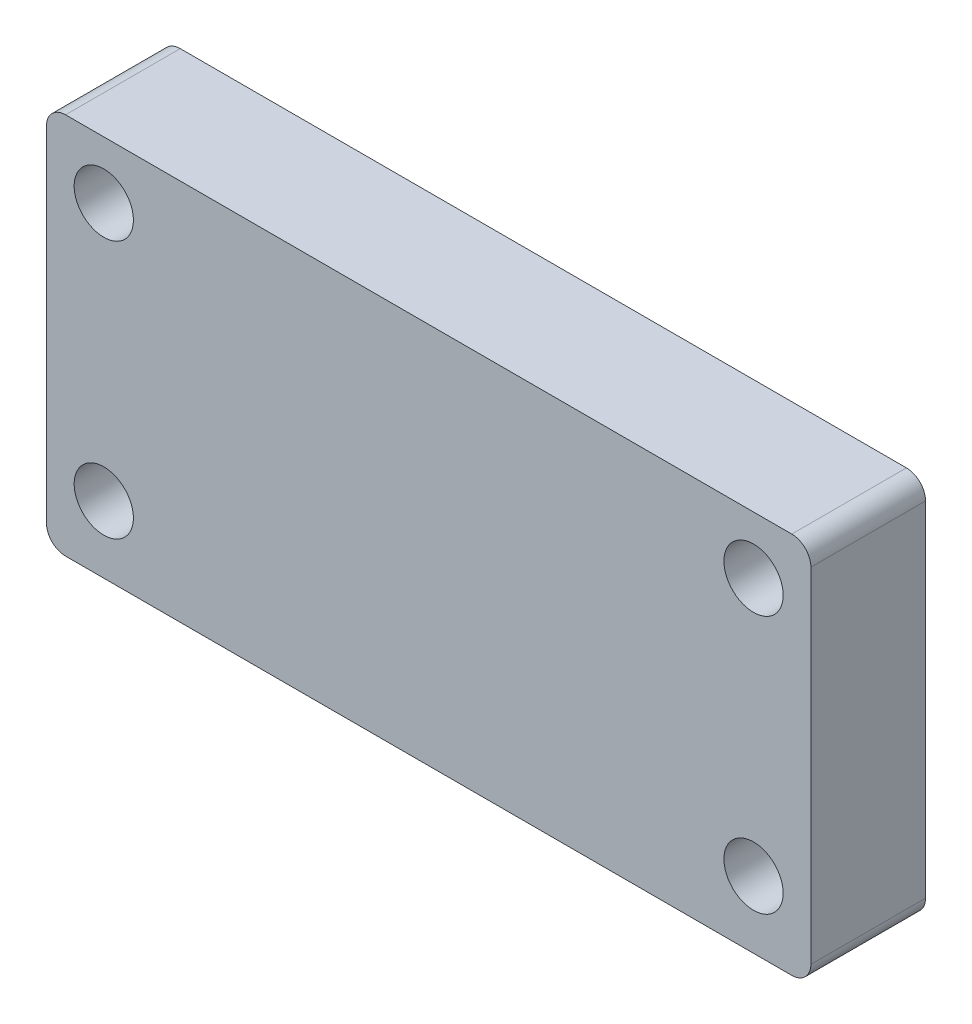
ISO-10303-21;
HEADER;
FILE_DESCRIPTION(('STEP AP214'),'2;1');
FILE_NAME('part.step','',(''),(''),'','','');
FILE_SCHEMA(('AUTOMOTIVE_DESIGN { 1 0 10303 214 1 1 1 1 }'));
ENDSEC;
DATA;
#1=APPLICATION_CONTEXT('core data for automotive mechanical design processes');
#2=APPLICATION_PROTOCOL_DEFINITION('international standard','automotive_design',2000,#1);
#3=PRODUCT_CONTEXT('',#1,'mechanical');
#4=PRODUCT('Part','Part','',(#3));
#5=PRODUCT_RELATED_PRODUCT_CATEGORY('part','',(#4));
#6=PRODUCT_DEFINITION_FORMATION('','',#4);
#7=PRODUCT_DEFINITION_CONTEXT('part definition',#1,'design');
#8=PRODUCT_DEFINITION('design','',#6,#7);
#9=PRODUCT_DEFINITION_SHAPE('','',#8);
#10=(LENGTH_UNIT() NAMED_UNIT(*) SI_UNIT(.MILLI.,.METRE.));
#11=(NAMED_UNIT(*) PLANE_ANGLE_UNIT() SI_UNIT($,.RADIAN.));
#12=(NAMED_UNIT(*) SI_UNIT($,.STERADIAN.) SOLID_ANGLE_UNIT());
#13=UNCERTAINTY_MEASURE_WITH_UNIT(LENGTH_MEASURE(1.E-05),#10,'distance_accuracy_value','');
#14=(GEOMETRIC_REPRESENTATION_CONTEXT(3) GLOBAL_UNCERTAINTY_ASSIGNED_CONTEXT((#13)) GLOBAL_UNIT_ASSIGNED_CONTEXT((#10,
#11,#12)) REPRESENTATION_CONTEXT('',''));
#15=CARTESIAN_POINT('',(0.,0.,0.));
#16=DIRECTION('',(0.,0.,1.));
#17=DIRECTION('',(1.,0.,0.));
#18=AXIS2_PLACEMENT_3D('',#15,#16,#17);
#19=CARTESIAN_POINT('',(0.,0.,0.));
#20=DIRECTION('',(0.,0.,-1.));
#21=DIRECTION('',(-1.,0.,0.));
#22=AXIS2_PLACEMENT_3D('',#19,#20,#21);
#23=PLANE('',#22);
#24=CARTESIAN_POINT('',(37.,3.5,0.));
#25=DIRECTION('',(0.,0.,1.));
#26=DIRECTION('',(1.,0.,0.));
#27=AXIS2_PLACEMENT_3D('',#24,#25,#26);
#28=CIRCLE('',#27,1.55);
#29=CARTESIAN_POINT('',(38.55,3.5,0.));
#30=VERTEX_POINT('',#29);
#31=EDGE_CURVE('E270',#30,#30,#28,.T.);
#32=ORIENTED_EDGE('',*,*,#31,.T.);
#33=EDGE_LOOP('',(#32));
#34=FACE_BOUND('',#33,.T.);
#35=CARTESIAN_POINT('',(3.,17.,0.));
#36=DIRECTION('',(0.,0.,1.));
#37=DIRECTION('',(1.,0.,0.));
#38=AXIS2_PLACEMENT_3D('',#35,#36,#37);
#39=CIRCLE('',#38,1.55);
#40=CARTESIAN_POINT('',(4.55,17.,0.));
#41=VERTEX_POINT('',#40);
#42=EDGE_CURVE('E258',#41,#41,#39,.T.);
#43=ORIENTED_EDGE('',*,*,#42,.T.);
#44=EDGE_LOOP('',(#43));
#45=FACE_BOUND('',#44,.T.);
#46=DIRECTION('',(0.,1.,0.));
#47=VECTOR('',#46,1.);
#48=CARTESIAN_POINT('',(40.,0.,0.));
#49=LINE('',#48,#47);
#50=CARTESIAN_POINT('',(40.,1.,0.));
#51=VERTEX_POINT('',#50);
#52=CARTESIAN_POINT('',(40.,19.,0.));
#53=VERTEX_POINT('',#52);
#54=EDGE_CURVE('E200',#51,#53,#49,.T.);
#55=ORIENTED_EDGE('',*,*,#54,.F.);
#56=CARTESIAN_POINT('',(39.,1.,0.));
#57=DIRECTION('',(0.,0.,-1.));
#58=DIRECTION('',(-1.,0.,0.));
#59=AXIS2_PLACEMENT_3D('',#56,#57,#58);
#60=CIRCLE('',#59,1.);
#61=CARTESIAN_POINT('',(39.,0.,0.));
#62=VERTEX_POINT('',#61);
#63=EDGE_CURVE('E153',#51,#62,#60,.T.);
#64=ORIENTED_EDGE('',*,*,#63,.T.);
#65=DIRECTION('',(1.,0.,0.));
#66=VECTOR('',#65,1.);
#67=CARTESIAN_POINT('',(0.,0.,0.));
#68=LINE('',#67,#66);
#69=CARTESIAN_POINT('',(1.,0.,0.));
#70=VERTEX_POINT('',#69);
#71=EDGE_CURVE('E195',#70,#62,#68,.T.);
#72=ORIENTED_EDGE('',*,*,#71,.F.);
#73=CARTESIAN_POINT('',(1.,1.,0.));
#74=DIRECTION('',(0.,0.,-1.));
#75=DIRECTION('',(-1.,0.,0.));
#76=AXIS2_PLACEMENT_3D('',#73,#74,#75);
#77=CIRCLE('',#76,1.);
#78=CARTESIAN_POINT('',(0.,1.,0.));
#79=VERTEX_POINT('',#78);
#80=EDGE_CURVE('E147',#70,#79,#77,.T.);
#81=ORIENTED_EDGE('',*,*,#80,.T.);
#82=DIRECTION('',(0.,-1.,0.));
#83=VECTOR('',#82,1.);
#84=CARTESIAN_POINT('',(0.,0.,0.));
#85=LINE('',#84,#83);
#86=CARTESIAN_POINT('',(0.,19.,0.));
#87=VERTEX_POINT('',#86);
#88=EDGE_CURVE('E179',#87,#79,#85,.T.);
#89=ORIENTED_EDGE('',*,*,#88,.F.);
#90=CARTESIAN_POINT('',(1.,19.,0.));
#91=DIRECTION('',(0.,0.,-1.));
#92=DIRECTION('',(-1.,0.,0.));
#93=AXIS2_PLACEMENT_3D('',#90,#91,#92);
#94=CIRCLE('',#93,1.);
#95=CARTESIAN_POINT('',(1.,20.,0.));
#96=VERTEX_POINT('',#95);
#97=EDGE_CURVE('E149',#87,#96,#94,.T.);
#98=ORIENTED_EDGE('',*,*,#97,.T.);
#99=DIRECTION('',(-1.,0.,0.));
#100=VECTOR('',#99,1.);
#101=CARTESIAN_POINT('',(0.,20.,0.));
#102=LINE('',#101,#100);
#103=CARTESIAN_POINT('',(39.,20.,0.));
#104=VERTEX_POINT('',#103);
#105=EDGE_CURVE('E188',#104,#96,#102,.T.);
#106=ORIENTED_EDGE('',*,*,#105,.F.);
#107=CARTESIAN_POINT('',(39.,19.,0.));
#108=DIRECTION('',(0.,0.,-1.));
#109=DIRECTION('',(-1.,0.,0.));
#110=AXIS2_PLACEMENT_3D('',#107,#108,#109);
#111=CIRCLE('',#110,1.);
#112=EDGE_CURVE('E151',#104,#53,#111,.T.);
#113=ORIENTED_EDGE('',*,*,#112,.T.);
#114=EDGE_LOOP('',(#55,#64,#72,#81,#89,#98,#106,#113));
#115=FACE_BOUND('',#114,.T.);
#116=CARTESIAN_POINT('',(37.,17.,0.));
#117=DIRECTION('',(0.,0.,1.));
#118=DIRECTION('',(1.,0.,0.));
#119=AXIS2_PLACEMENT_3D('',#116,#117,#118);
#120=CIRCLE('',#119,1.55);
#121=CARTESIAN_POINT('',(38.55,17.,0.));
#122=VERTEX_POINT('',#121);
#123=EDGE_CURVE('E264',#122,#122,#120,.T.);
#124=ORIENTED_EDGE('',*,*,#123,.T.);
#125=EDGE_LOOP('',(#124));
#126=FACE_BOUND('',#125,.T.);
#127=CARTESIAN_POINT('',(3.,3.5,0.));
#128=DIRECTION('',(0.,0.,1.));
#129=DIRECTION('',(1.,0.,0.));
#130=AXIS2_PLACEMENT_3D('',#127,#128,#129);
#131=CIRCLE('',#130,1.55);
#132=CARTESIAN_POINT('',(4.55,3.5,0.));
#133=VERTEX_POINT('',#132);
#134=EDGE_CURVE('E275',#133,#133,#131,.T.);
#135=ORIENTED_EDGE('',*,*,#134,.T.);
#136=EDGE_LOOP('',(#135));
#137=FACE_BOUND('',#136,.T.);
#138=DIRECTION('',(-1.,0.,0.));
#139=VECTOR('',#138,1.);
#140=CARTESIAN_POINT('',(30.5,6.40983005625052,0.));
#141=LINE('',#140,#139);
#142=CARTESIAN_POINT('',(30.5,6.40983005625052,0.));
#143=VERTEX_POINT('',#142);
#144=CARTESIAN_POINT('',(5.5,6.40983005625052,0.));
#145=VERTEX_POINT('',#144);
#146=EDGE_CURVE('E132',#143,#145,#141,.T.);
#147=ORIENTED_EDGE('',*,*,#146,.F.);
#148=DIRECTION('',(0.,1.,0.));
#149=VECTOR('',#148,1.);
#150=CARTESIAN_POINT('',(30.5,0.,0.));
#151=LINE('',#150,#149);
#152=CARTESIAN_POINT('',(30.5,17.5901699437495,0.));
#153=VERTEX_POINT('',#152);
#154=EDGE_CURVE('E136',#143,#153,#151,.T.);
#155=ORIENTED_EDGE('',*,*,#154,.T.);
#156=DIRECTION('',(-1.,0.,0.));
#157=VECTOR('',#156,1.);
#158=CARTESIAN_POINT('',(30.5,17.5901699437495,0.));
#159=LINE('',#158,#157);
#160=CARTESIAN_POINT('',(5.5,17.5901699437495,0.));
#161=VERTEX_POINT('',#160);
#162=EDGE_CURVE('E125',#161,#153,#159,.F.);
#163=ORIENTED_EDGE('',*,*,#162,.F.);
#164=DIRECTION('',(0.,1.,0.));
#165=VECTOR('',#164,1.);
#166=CARTESIAN_POINT('',(5.5,0.,0.));
#167=LINE('',#166,#165);
#168=EDGE_CURVE('E117',#145,#161,#167,.T.);
#169=ORIENTED_EDGE('',*,*,#168,.F.);
#170=EDGE_LOOP('',(#147,#155,#163,#169));
#171=FACE_BOUND('',#170,.T.);
#172=ADVANCED_FACE('F39',(#34,#45,#115,#126,#137,#171),#23,.T.);
#173=CARTESIAN_POINT('',(0.,0.,6.));
#174=DIRECTION('',(0.,0.,-1.));
#175=DIRECTION('',(-1.,0.,0.));
#176=AXIS2_PLACEMENT_3D('',#173,#174,#175);
#177=PLANE('',#176);
#178=DIRECTION('',(1.,0.,0.));
#179=VECTOR('',#178,1.);
#180=CARTESIAN_POINT('',(0.,0.,6.));
#181=LINE('',#180,#179);
#182=CARTESIAN_POINT('',(1.,0.,6.));
#183=VERTEX_POINT('',#182);
#184=CARTESIAN_POINT('',(39.,0.,6.));
#185=VERTEX_POINT('',#184);
#186=EDGE_CURVE('E187',#183,#185,#181,.T.);
#187=ORIENTED_EDGE('',*,*,#186,.T.);
#188=CARTESIAN_POINT('',(39.,1.,6.));
#189=DIRECTION('',(0.,0.,-1.));
#190=DIRECTION('',(-1.,0.,0.));
#191=AXIS2_PLACEMENT_3D('',#188,#189,#190);
#192=CIRCLE('',#191,1.);
#193=CARTESIAN_POINT('',(40.,1.,6.));
#194=VERTEX_POINT('',#193);
#195=EDGE_CURVE('E165',#185,#194,#192,.F.);
#196=ORIENTED_EDGE('',*,*,#195,.T.);
#197=DIRECTION('',(0.,1.,0.));
#198=VECTOR('',#197,1.);
#199=CARTESIAN_POINT('',(40.,0.,6.));
#200=LINE('',#199,#198);
#201=CARTESIAN_POINT('',(40.,19.,6.));
#202=VERTEX_POINT('',#201);
#203=EDGE_CURVE('E253',#194,#202,#200,.T.);
#204=ORIENTED_EDGE('',*,*,#203,.T.);
#205=CARTESIAN_POINT('',(39.,19.,6.));
#206=DIRECTION('',(0.,0.,-1.));
#207=DIRECTION('',(-1.,0.,0.));
#208=AXIS2_PLACEMENT_3D('',#205,#206,#207);
#209=CIRCLE('',#208,1.);
#210=CARTESIAN_POINT('',(39.,20.,6.));
#211=VERTEX_POINT('',#210);
#212=EDGE_CURVE('E61',#202,#211,#209,.F.);
#213=ORIENTED_EDGE('',*,*,#212,.T.);
#214=DIRECTION('',(-1.,0.,0.));
#215=VECTOR('',#214,1.);
#216=CARTESIAN_POINT('',(0.,20.,6.));
#217=LINE('',#216,#215);
#218=CARTESIAN_POINT('',(1.,20.,6.));
#219=VERTEX_POINT('',#218);
#220=EDGE_CURVE('E126',#211,#219,#217,.T.);
#221=ORIENTED_EDGE('',*,*,#220,.T.);
#222=CARTESIAN_POINT('',(1.,19.,6.));
#223=DIRECTION('',(0.,0.,-1.));
#224=DIRECTION('',(-1.,0.,0.));
#225=AXIS2_PLACEMENT_3D('',#222,#223,#224);
#226=CIRCLE('',#225,1.);
#227=CARTESIAN_POINT('',(0.,19.,6.));
#228=VERTEX_POINT('',#227);
#229=EDGE_CURVE('E162',#219,#228,#226,.F.);
#230=ORIENTED_EDGE('',*,*,#229,.T.);
#231=DIRECTION('',(0.,-1.,0.));
#232=VECTOR('',#231,1.);
#233=CARTESIAN_POINT('',(0.,0.,6.));
#234=LINE('',#233,#232);
#235=CARTESIAN_POINT('',(0.,1.,6.));
#236=VERTEX_POINT('',#235);
#237=EDGE_CURVE('E176',#228,#236,#234,.T.);
#238=ORIENTED_EDGE('',*,*,#237,.T.);
#239=CARTESIAN_POINT('',(1.,1.,6.));
#240=DIRECTION('',(0.,0.,-1.));
#241=DIRECTION('',(-1.,0.,0.));
#242=AXIS2_PLACEMENT_3D('',#239,#240,#241);
#243=CIRCLE('',#242,1.);
#244=EDGE_CURVE('E160',#236,#183,#243,.F.);
#245=ORIENTED_EDGE('',*,*,#244,.T.);
#246=EDGE_LOOP('',(#187,#196,#204,#213,#221,#230,#238,#245));
#247=FACE_BOUND('',#246,.T.);
#248=CARTESIAN_POINT('',(3.,17.,6.));
#249=DIRECTION('',(0.,0.,1.));
#250=DIRECTION('',(1.,0.,0.));
#251=AXIS2_PLACEMENT_3D('',#248,#249,#250);
#252=CIRCLE('',#251,1.55);
#253=CARTESIAN_POINT('',(4.55,17.,6.));
#254=VERTEX_POINT('',#253);
#255=EDGE_CURVE('E204',#254,#254,#252,.T.);
#256=ORIENTED_EDGE('',*,*,#255,.F.);
#257=EDGE_LOOP('',(#256));
#258=FACE_BOUND('',#257,.T.);
#259=CARTESIAN_POINT('',(37.,17.,6.));
#260=DIRECTION('',(0.,0.,1.));
#261=DIRECTION('',(1.,0.,0.));
#262=AXIS2_PLACEMENT_3D('',#259,#260,#261);
#263=CIRCLE('',#262,1.55);
#264=CARTESIAN_POINT('',(38.55,17.,6.));
#265=VERTEX_POINT('',#264);
#266=EDGE_CURVE('E261',#265,#265,#263,.T.);
#267=ORIENTED_EDGE('',*,*,#266,.F.);
#268=EDGE_LOOP('',(#267));
#269=FACE_BOUND('',#268,.T.);
#270=CARTESIAN_POINT('',(37.,3.5,6.));
#271=DIRECTION('',(0.,0.,1.));
#272=DIRECTION('',(1.,0.,0.));
#273=AXIS2_PLACEMENT_3D('',#270,#271,#272);
#274=CIRCLE('',#273,1.55);
#275=CARTESIAN_POINT('',(38.55,3.5,6.));
#276=VERTEX_POINT('',#275);
#277=EDGE_CURVE('E267',#276,#276,#274,.T.);
#278=ORIENTED_EDGE('',*,*,#277,.F.);
#279=EDGE_LOOP('',(#278));
#280=FACE_BOUND('',#279,.T.);
#281=CARTESIAN_POINT('',(3.,3.5,6.));
#282=DIRECTION('',(0.,0.,1.));
#283=DIRECTION('',(1.,0.,0.));
#284=AXIS2_PLACEMENT_3D('',#281,#282,#283);
#285=CIRCLE('',#284,1.55);
#286=CARTESIAN_POINT('',(4.55,3.5,6.));
#287=VERTEX_POINT('',#286);
#288=EDGE_CURVE('E272',#287,#287,#285,.T.);
#289=ORIENTED_EDGE('',*,*,#288,.F.);
#290=EDGE_LOOP('',(#289));
#291=FACE_BOUND('',#290,.T.);
#292=ADVANCED_FACE('F183',(#247,#258,#269,#280,#291),#177,.F.);
#293=CARTESIAN_POINT('',(0.,0.,6.));
#294=DIRECTION('',(1.,0.,0.));
#295=DIRECTION('',(0.,0.,-1.));
#296=AXIS2_PLACEMENT_3D('',#293,#294,#295);
#297=PLANE('',#296);
#298=ORIENTED_EDGE('',*,*,#237,.F.);
#299=DIRECTION('',(0.,0.,-1.));
#300=VECTOR('',#299,1.);
#301=CARTESIAN_POINT('',(0.,19.,6.));
#302=LINE('',#301,#300);
#303=EDGE_CURVE('E11',#228,#87,#302,.T.);
#304=ORIENTED_EDGE('',*,*,#303,.T.);
#305=ORIENTED_EDGE('',*,*,#88,.T.);
#306=DIRECTION('',(0.,0.,-1.));
#307=VECTOR('',#306,1.);
#308=CARTESIAN_POINT('',(0.,1.,6.));
#309=LINE('',#308,#307);
#310=EDGE_CURVE('E47',#79,#236,#309,.F.);
#311=ORIENTED_EDGE('',*,*,#310,.T.);
#312=EDGE_LOOP('',(#298,#304,#305,#311));
#313=FACE_BOUND('',#312,.T.);
#314=ADVANCED_FACE('F175',(#313),#297,.F.);
#315=CARTESIAN_POINT('',(0.,0.,6.));
#316=DIRECTION('',(0.,1.,0.));
#317=DIRECTION('',(0.,0.,1.));
#318=AXIS2_PLACEMENT_3D('',#315,#316,#317);
#319=PLANE('',#318);
#320=ORIENTED_EDGE('',*,*,#71,.T.);
#321=DIRECTION('',(0.,0.,-1.));
#322=VECTOR('',#321,1.);
#323=CARTESIAN_POINT('',(39.,0.,6.));
#324=LINE('',#323,#322);
#325=EDGE_CURVE('E158',#62,#185,#324,.F.);
#326=ORIENTED_EDGE('',*,*,#325,.T.);
#327=ORIENTED_EDGE('',*,*,#186,.F.);
#328=DIRECTION('',(0.,0.,-1.));
#329=VECTOR('',#328,1.);
#330=CARTESIAN_POINT('',(1.,0.,6.));
#331=LINE('',#330,#329);
#332=EDGE_CURVE('E155',#183,#70,#331,.T.);
#333=ORIENTED_EDGE('',*,*,#332,.T.);
#334=EDGE_LOOP('',(#320,#326,#327,#333));
#335=FACE_BOUND('',#334,.T.);
#336=ADVANCED_FACE('F194',(#335),#319,.F.);
#337=CARTESIAN_POINT('',(40.,0.,6.));
#338=DIRECTION('',(-1.,0.,0.));
#339=DIRECTION('',(0.,0.,1.));
#340=AXIS2_PLACEMENT_3D('',#337,#338,#339);
#341=PLANE('',#340);
#342=ORIENTED_EDGE('',*,*,#203,.F.);
#343=DIRECTION('',(0.,0.,-1.));
#344=VECTOR('',#343,1.);
#345=CARTESIAN_POINT('',(40.,1.,6.));
#346=LINE('',#345,#344);
#347=EDGE_CURVE('E144',#194,#51,#346,.T.);
#348=ORIENTED_EDGE('',*,*,#347,.T.);
#349=ORIENTED_EDGE('',*,*,#54,.T.);
#350=DIRECTION('',(0.,0.,-1.));
#351=VECTOR('',#350,1.);
#352=CARTESIAN_POINT('',(40.,19.,6.));
#353=LINE('',#352,#351);
#354=EDGE_CURVE('E142',#53,#202,#353,.F.);
#355=ORIENTED_EDGE('',*,*,#354,.T.);
#356=EDGE_LOOP('',(#342,#348,#349,#355));
#357=FACE_BOUND('',#356,.T.);
#358=ADVANCED_FACE('F236',(#357),#341,.F.);
#359=CARTESIAN_POINT('',(0.,20.,6.));
#360=DIRECTION('',(0.,-1.,0.));
#361=DIRECTION('',(0.,0.,-1.));
#362=AXIS2_PLACEMENT_3D('',#359,#360,#361);
#363=PLANE('',#362);
#364=ORIENTED_EDGE('',*,*,#220,.F.);
#365=DIRECTION('',(0.,0.,-1.));
#366=VECTOR('',#365,1.);
#367=CARTESIAN_POINT('',(39.,20.,6.));
#368=LINE('',#367,#366);
#369=EDGE_CURVE('E168',#211,#104,#368,.T.);
#370=ORIENTED_EDGE('',*,*,#369,.T.);
#371=ORIENTED_EDGE('',*,*,#105,.T.);
#372=DIRECTION('',(0.,0.,-1.));
#373=VECTOR('',#372,1.);
#374=CARTESIAN_POINT('',(1.,20.,6.));
#375=LINE('',#374,#373);
#376=EDGE_CURVE('E54',#96,#219,#375,.F.);
#377=ORIENTED_EDGE('',*,*,#376,.T.);
#378=EDGE_LOOP('',(#364,#370,#371,#377));
#379=FACE_BOUND('',#378,.T.);
#380=ADVANCED_FACE('F208',(#379),#363,.F.);
#381=CARTESIAN_POINT('',(3.,17.,6.));
#382=DIRECTION('',(0.,0.,-1.));
#383=DIRECTION('',(-1.,0.,0.));
#384=AXIS2_PLACEMENT_3D('',#381,#382,#383);
#385=CYLINDRICAL_SURFACE('',#384,1.55);
#386=ORIENTED_EDGE('',*,*,#255,.T.);
#387=EDGE_LOOP('',(#386));
#388=FACE_BOUND('',#387,.T.);
#389=ORIENTED_EDGE('',*,*,#42,.F.);
#390=EDGE_LOOP('',(#389));
#391=FACE_BOUND('',#390,.T.);
#392=ADVANCED_FACE('F235',(#388,#391),#385,.F.);
#393=CARTESIAN_POINT('',(37.,17.,6.));
#394=DIRECTION('',(0.,0.,-1.));
#395=DIRECTION('',(-1.,0.,0.));
#396=AXIS2_PLACEMENT_3D('',#393,#394,#395);
#397=CYLINDRICAL_SURFACE('',#396,1.55);
#398=ORIENTED_EDGE('',*,*,#266,.T.);
#399=EDGE_LOOP('',(#398));
#400=FACE_BOUND('',#399,.T.);
#401=ORIENTED_EDGE('',*,*,#123,.F.);
#402=EDGE_LOOP('',(#401));
#403=FACE_BOUND('',#402,.T.);
#404=ADVANCED_FACE('F295',(#400,#403),#397,.F.);
#405=CARTESIAN_POINT('',(37.,3.5,6.));
#406=DIRECTION('',(0.,0.,-1.));
#407=DIRECTION('',(-1.,0.,0.));
#408=AXIS2_PLACEMENT_3D('',#405,#406,#407);
#409=CYLINDRICAL_SURFACE('',#408,1.55);
#410=ORIENTED_EDGE('',*,*,#277,.T.);
#411=EDGE_LOOP('',(#410));
#412=FACE_BOUND('',#411,.T.);
#413=ORIENTED_EDGE('',*,*,#31,.F.);
#414=EDGE_LOOP('',(#413));
#415=FACE_BOUND('',#414,.T.);
#416=ADVANCED_FACE('F291',(#412,#415),#409,.F.);
#417=CARTESIAN_POINT('',(3.,3.5,6.));
#418=DIRECTION('',(0.,0.,-1.));
#419=DIRECTION('',(-1.,0.,0.));
#420=AXIS2_PLACEMENT_3D('',#417,#418,#419);
#421=CYLINDRICAL_SURFACE('',#420,1.55);
#422=ORIENTED_EDGE('',*,*,#288,.T.);
#423=EDGE_LOOP('',(#422));
#424=FACE_BOUND('',#423,.T.);
#425=ORIENTED_EDGE('',*,*,#134,.F.);
#426=EDGE_LOOP('',(#425));
#427=FACE_BOUND('',#426,.T.);
#428=ADVANCED_FACE('F286',(#424,#427),#421,.F.);
#429=CARTESIAN_POINT('',(30.5,12.,-5.));
#430=DIRECTION('',(-1.,0.,0.));
#431=DIRECTION('',(0.,0.,1.));
#432=AXIS2_PLACEMENT_3D('',#429,#430,#431);
#433=CYLINDRICAL_SURFACE('',#432,7.5);
#434=ORIENTED_EDGE('',*,*,#146,.T.);
#435=CARTESIAN_POINT('',(5.5,12.,-5.));
#436=DIRECTION('',(-1.,0.,0.));
#437=DIRECTION('',(0.,0.,1.));
#438=AXIS2_PLACEMENT_3D('',#435,#436,#437);
#439=CIRCLE('',#438,7.5);
#440=EDGE_CURVE('E120',#145,#161,#439,.T.);
#441=ORIENTED_EDGE('',*,*,#440,.T.);
#442=ORIENTED_EDGE('',*,*,#162,.T.);
#443=CARTESIAN_POINT('',(30.5,12.,-5.));
#444=DIRECTION('',(-1.,0.,0.));
#445=DIRECTION('',(0.,0.,1.));
#446=AXIS2_PLACEMENT_3D('',#443,#444,#445);
#447=CIRCLE('',#446,7.5);
#448=EDGE_CURVE('E133',#143,#153,#447,.T.);
#449=ORIENTED_EDGE('',*,*,#448,.F.);
#450=EDGE_LOOP('',(#434,#441,#442,#449));
#451=FACE_BOUND('',#450,.T.);
#452=ADVANCED_FACE('F129',(#451),#433,.F.);
#453=CARTESIAN_POINT('',(30.5,12.,-5.));
#454=DIRECTION('',(-1.,0.,0.));
#455=DIRECTION('',(0.,0.,1.));
#456=AXIS2_PLACEMENT_3D('',#453,#454,#455);
#457=PLANE('',#456);
#458=ORIENTED_EDGE('',*,*,#448,.T.);
#459=ORIENTED_EDGE('',*,*,#154,.F.);
#460=EDGE_LOOP('',(#458,#459));
#461=FACE_BOUND('',#460,.T.);
#462=ADVANCED_FACE('F248',(#461),#457,.T.);
#463=CARTESIAN_POINT('',(5.5,12.,-5.));
#464=DIRECTION('',(-1.,0.,0.));
#465=DIRECTION('',(0.,0.,1.));
#466=AXIS2_PLACEMENT_3D('',#463,#464,#465);
#467=PLANE('',#466);
#468=ORIENTED_EDGE('',*,*,#168,.T.);
#469=ORIENTED_EDGE('',*,*,#440,.F.);
#470=EDGE_LOOP('',(#468,#469));
#471=FACE_BOUND('',#470,.T.);
#472=ADVANCED_FACE('F119',(#471),#467,.F.);
#473=CARTESIAN_POINT('',(39.,1.,6.));
#474=DIRECTION('',(0.,0.,-1.));
#475=DIRECTION('',(-1.,0.,0.));
#476=AXIS2_PLACEMENT_3D('',#473,#474,#475);
#477=CYLINDRICAL_SURFACE('',#476,1.);
#478=ORIENTED_EDGE('',*,*,#195,.F.);
#479=ORIENTED_EDGE('',*,*,#325,.F.);
#480=ORIENTED_EDGE('',*,*,#63,.F.);
#481=ORIENTED_EDGE('',*,*,#347,.F.);
#482=EDGE_LOOP('',(#478,#479,#480,#481));
#483=FACE_BOUND('',#482,.T.);
#484=ADVANCED_FACE('F218',(#483),#477,.T.);
#485=CARTESIAN_POINT('',(39.,19.,6.));
#486=DIRECTION('',(0.,0.,-1.));
#487=DIRECTION('',(-1.,0.,0.));
#488=AXIS2_PLACEMENT_3D('',#485,#486,#487);
#489=CYLINDRICAL_SURFACE('',#488,1.);
#490=ORIENTED_EDGE('',*,*,#212,.F.);
#491=ORIENTED_EDGE('',*,*,#354,.F.);
#492=ORIENTED_EDGE('',*,*,#112,.F.);
#493=ORIENTED_EDGE('',*,*,#369,.F.);
#494=EDGE_LOOP('',(#490,#491,#492,#493));
#495=FACE_BOUND('',#494,.T.);
#496=ADVANCED_FACE('F213',(#495),#489,.T.);
#497=CARTESIAN_POINT('',(1.,19.,6.));
#498=DIRECTION('',(0.,0.,-1.));
#499=DIRECTION('',(-1.,0.,0.));
#500=AXIS2_PLACEMENT_3D('',#497,#498,#499);
#501=CYLINDRICAL_SURFACE('',#500,1.);
#502=ORIENTED_EDGE('',*,*,#229,.F.);
#503=ORIENTED_EDGE('',*,*,#376,.F.);
#504=ORIENTED_EDGE('',*,*,#97,.F.);
#505=ORIENTED_EDGE('',*,*,#303,.F.);
#506=EDGE_LOOP('',(#502,#503,#504,#505));
#507=FACE_BOUND('',#506,.T.);
#508=ADVANCED_FACE('F211',(#507),#501,.T.);
#509=CARTESIAN_POINT('',(1.,1.,6.));
#510=DIRECTION('',(0.,0.,-1.));
#511=DIRECTION('',(-1.,0.,0.));
#512=AXIS2_PLACEMENT_3D('',#509,#510,#511);
#513=CYLINDRICAL_SURFACE('',#512,1.);
#514=ORIENTED_EDGE('',*,*,#244,.F.);
#515=ORIENTED_EDGE('',*,*,#310,.F.);
#516=ORIENTED_EDGE('',*,*,#80,.F.);
#517=ORIENTED_EDGE('',*,*,#332,.F.);
#518=EDGE_LOOP('',(#514,#515,#516,#517));
#519=FACE_BOUND('',#518,.T.);
#520=ADVANCED_FACE('F41',(#519),#513,.T.);
#521=CLOSED_SHELL('',(#172,#292,#314,#336,#358,#380,#392,#404,#416,#428,#452,#462,#472,#484,
#496,#508,#520));
#522=MANIFOLD_SOLID_BREP('B2',#521);
#523=ADVANCED_BREP_SHAPE_REPRESENTATION('',(#18,#522),#14);
#524=SHAPE_DEFINITION_REPRESENTATION(#9,#523);
ENDSEC;
END-ISO-10303-21;
